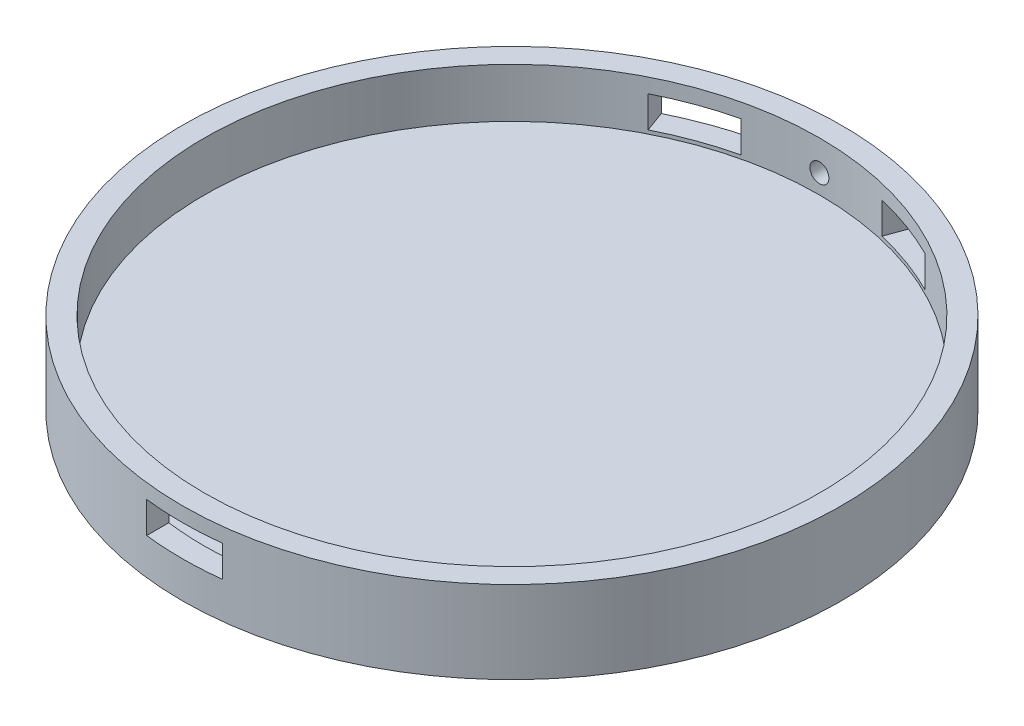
ISO-10303-21;
HEADER;
FILE_DESCRIPTION(('STEP AP214'),'2;1');
FILE_NAME('part.step','',(''),(''),'','','');
FILE_SCHEMA(('AUTOMOTIVE_DESIGN { 1 0 10303 214 1 1 1 1 }'));
ENDSEC;
DATA;
#1=APPLICATION_CONTEXT('core data for automotive mechanical design processes');
#2=APPLICATION_PROTOCOL_DEFINITION('international standard','automotive_design',2000,#1);
#3=PRODUCT_CONTEXT('',#1,'mechanical');
#4=PRODUCT('Part','Part','',(#3));
#5=PRODUCT_RELATED_PRODUCT_CATEGORY('part','',(#4));
#6=PRODUCT_DEFINITION_FORMATION('','',#4);
#7=PRODUCT_DEFINITION_CONTEXT('part definition',#1,'design');
#8=PRODUCT_DEFINITION('design','',#6,#7);
#9=PRODUCT_DEFINITION_SHAPE('','',#8);
#10=(LENGTH_UNIT() NAMED_UNIT(*) SI_UNIT(.MILLI.,.METRE.));
#11=(NAMED_UNIT(*) PLANE_ANGLE_UNIT() SI_UNIT($,.RADIAN.));
#12=(NAMED_UNIT(*) SI_UNIT($,.STERADIAN.) SOLID_ANGLE_UNIT());
#13=UNCERTAINTY_MEASURE_WITH_UNIT(LENGTH_MEASURE(1.E-05),#10,'distance_accuracy_value','');
#14=(GEOMETRIC_REPRESENTATION_CONTEXT(3) GLOBAL_UNCERTAINTY_ASSIGNED_CONTEXT((#13)) GLOBAL_UNIT_ASSIGNED_CONTEXT((#10,
#11,#12)) REPRESENTATION_CONTEXT('',''));
#15=CARTESIAN_POINT('',(0.,0.,0.));
#16=DIRECTION('',(0.,0.,1.));
#17=DIRECTION('',(1.,0.,0.));
#18=AXIS2_PLACEMENT_3D('',#15,#16,#17);
#19=CARTESIAN_POINT('',(0.,15.,0.));
#20=DIRECTION('',(0.,-1.,0.));
#21=DIRECTION('',(0.,0.,-1.));
#22=AXIS2_PLACEMENT_3D('',#19,#20,#21);
#23=CYLINDRICAL_SURFACE('',#22,60.);
#24=DIRECTION('',(0.,-1.,0.));
#25=VECTOR('',#24,1.);
#26=CARTESIAN_POINT('',(-14.2044812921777,15.,-58.2943626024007));
#27=LINE('',#26,#25);
#28=CARTESIAN_POINT('',(-14.2044812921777,6.65,-58.2943626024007));
#29=VERTEX_POINT('',#28);
#30=CARTESIAN_POINT('',(-14.2044812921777,12.35,-58.2943626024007));
#31=VERTEX_POINT('',#30);
#32=EDGE_CURVE('E205',#29,#31,#27,.F.);
#33=ORIENTED_EDGE('',*,*,#32,.T.);
#34=CARTESIAN_POINT('',(0.,12.35,0.));
#35=DIRECTION('',(0.,1.,0.));
#36=DIRECTION('',(-1.,0.,0.));
#37=AXIS2_PLACEMENT_3D('',#34,#35,#36);
#38=CIRCLE('',#37,60.);
#39=CARTESIAN_POINT('',(-26.589630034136,12.35,-53.7865371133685));
#40=VERTEX_POINT('',#39);
#41=EDGE_CURVE('E195',#31,#40,#38,.T.);
#42=ORIENTED_EDGE('',*,*,#41,.T.);
#43=DIRECTION('',(0.,-1.,0.));
#44=VECTOR('',#43,1.);
#45=CARTESIAN_POINT('',(-26.589630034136,15.,-53.7865371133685));
#46=LINE('',#45,#44);
#47=CARTESIAN_POINT('',(-26.589630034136,6.65,-53.7865371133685));
#48=VERTEX_POINT('',#47);
#49=EDGE_CURVE('E210',#40,#48,#46,.T.);
#50=ORIENTED_EDGE('',*,*,#49,.T.);
#51=CARTESIAN_POINT('',(0.,6.65,0.));
#52=DIRECTION('',(0.,-1.,0.));
#53=DIRECTION('',(1.,0.,0.));
#54=AXIS2_PLACEMENT_3D('',#51,#52,#53);
#55=CIRCLE('',#54,60.);
#56=EDGE_CURVE('E208',#48,#29,#55,.T.);
#57=ORIENTED_EDGE('',*,*,#56,.T.);
#58=EDGE_LOOP('',(#33,#42,#50,#57));
#59=FACE_BOUND('',#58,.T.);
#60=DIRECTION('',(0.,-1.,0.));
#61=VECTOR('',#60,1.);
#62=CARTESIAN_POINT('',(14.2044812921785,15.,-58.2943626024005));
#63=LINE('',#62,#61);
#64=CARTESIAN_POINT('',(14.2044812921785,12.35,-58.2943626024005));
#65=VERTEX_POINT('',#64);
#66=CARTESIAN_POINT('',(14.2044812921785,6.65,-58.2943626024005));
#67=VERTEX_POINT('',#66);
#68=EDGE_CURVE('E227',#65,#67,#63,.T.);
#69=ORIENTED_EDGE('',*,*,#68,.T.);
#70=CARTESIAN_POINT('',(0.,6.65,0.));
#71=DIRECTION('',(0.,-1.,0.));
#72=DIRECTION('',(1.,0.,0.));
#73=AXIS2_PLACEMENT_3D('',#70,#71,#72);
#74=CIRCLE('',#73,60.);
#75=CARTESIAN_POINT('',(26.5896300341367,6.65,-53.7865371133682));
#76=VERTEX_POINT('',#75);
#77=EDGE_CURVE('E217',#67,#76,#74,.T.);
#78=ORIENTED_EDGE('',*,*,#77,.T.);
#79=DIRECTION('',(0.,-1.,0.));
#80=VECTOR('',#79,1.);
#81=CARTESIAN_POINT('',(26.5896300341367,15.,-53.7865371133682));
#82=LINE('',#81,#80);
#83=CARTESIAN_POINT('',(26.5896300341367,12.35,-53.7865371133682));
#84=VERTEX_POINT('',#83);
#85=EDGE_CURVE('E232',#76,#84,#82,.F.);
#86=ORIENTED_EDGE('',*,*,#85,.T.);
#87=CARTESIAN_POINT('',(0.,12.35,0.));
#88=DIRECTION('',(0.,1.,0.));
#89=DIRECTION('',(-1.,0.,0.));
#90=AXIS2_PLACEMENT_3D('',#87,#88,#89);
#91=CIRCLE('',#90,60.);
#92=EDGE_CURVE('E230',#84,#65,#91,.T.);
#93=ORIENTED_EDGE('',*,*,#92,.T.);
#94=EDGE_LOOP('',(#69,#78,#86,#93));
#95=FACE_BOUND('',#94,.T.);
#96=CARTESIAN_POINT('',(0.,11.225,-60.));
#97=CARTESIAN_POINT('',(-0.0968725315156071,11.2249957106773,-59.999999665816));
#98=CARTESIAN_POINT('',(-0.193814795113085,11.2168123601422,-59.9997628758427));
#99=CARTESIAN_POINT('',(-0.385028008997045,11.1842817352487,-59.9988410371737));
#100=CARTESIAN_POINT('',(-0.479295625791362,11.1599151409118,-59.9981554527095));
#101=CARTESIAN_POINT('',(-0.662361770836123,11.0957135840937,-59.996413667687));
#102=CARTESIAN_POINT('',(-0.751162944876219,11.0558861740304,-59.9953576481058));
#103=CARTESIAN_POINT('',(-0.920794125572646,10.9619043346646,-59.9929941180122));
#104=CARTESIAN_POINT('',(-1.0016260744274,10.907753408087,-59.9916866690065));
#105=CARTESIAN_POINT('',(-1.15308398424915,10.786634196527,-59.9889668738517));
#106=CARTESIAN_POINT('',(-1.22370623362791,10.7196612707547,-59.9875544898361));
#107=CARTESIAN_POINT('',(-1.35270886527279,10.5748071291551,-59.9847843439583));
#108=CARTESIAN_POINT('',(-1.41108876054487,10.4969254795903,-59.9834265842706));
#109=CARTESIAN_POINT('',(-1.51395478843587,10.3324515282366,-59.9809186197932));
#110=CARTESIAN_POINT('',(-1.55843877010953,10.2458578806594,-59.9797684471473));
#111=CARTESIAN_POINT('',(-1.63223619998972,10.0664276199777,-59.9778056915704));
#112=CARTESIAN_POINT('',(-1.66154970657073,9.9735910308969,-59.9769931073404));
#113=CARTESIAN_POINT('',(-1.7041663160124,9.78433749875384,-59.9757974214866));
#114=CARTESIAN_POINT('',(-1.71747387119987,9.68792155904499,-59.9754142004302));
#115=CARTESIAN_POINT('',(-1.72771453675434,9.49422353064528,-59.9751200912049));
#116=CARTESIAN_POINT('',(-1.72464770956,9.39694144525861,-59.975209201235));
#117=CARTESIAN_POINT('',(-1.70223044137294,9.2043028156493,-59.9758495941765));
#118=CARTESIAN_POINT('',(-1.68288481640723,9.1089457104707,-59.976400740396));
#119=CARTESIAN_POINT('',(-1.62846655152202,8.9228331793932,-59.9779028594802));
#120=CARTESIAN_POINT('',(-1.59339387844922,8.83207776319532,-59.9788538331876));
#121=CARTESIAN_POINT('',(-1.50851157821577,8.65772935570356,-59.9810485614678));
#122=CARTESIAN_POINT('',(-1.45869974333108,8.57413743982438,-59.9822923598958));
#123=CARTESIAN_POINT('',(-1.34575474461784,8.41650071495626,-59.9849324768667));
#124=CARTESIAN_POINT('',(-1.2826215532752,8.34245592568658,-59.9863287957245));
#125=CARTESIAN_POINT('',(-1.14479871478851,8.20598725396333,-59.9891171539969));
#126=CARTESIAN_POINT('',(-1.07010489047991,8.14356759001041,-59.9905091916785));
#127=CARTESIAN_POINT('',(-0.911295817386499,8.03215352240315,-59.9931315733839));
#128=CARTESIAN_POINT('',(-0.827180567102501,7.98315912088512,-59.9943619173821));
#129=CARTESIAN_POINT('',(-0.651914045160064,7.89998683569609,-59.9965222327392));
#130=CARTESIAN_POINT('',(-0.560762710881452,7.86580908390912,-59.9974522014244));
#131=CARTESIAN_POINT('',(-0.374012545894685,7.81324297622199,-59.9989068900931));
#132=CARTESIAN_POINT('',(-0.278413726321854,7.79485458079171,-59.9994316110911));
#133=CARTESIAN_POINT('',(-0.0855189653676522,7.77439433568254,-60.0000165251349));
#134=CARTESIAN_POINT('',(0.0117763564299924,7.77231664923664,-60.0000768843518));
#135=CARTESIAN_POINT('',(0.205334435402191,7.78452159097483,-59.9997267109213));
#136=CARTESIAN_POINT('',(0.301597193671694,7.79880420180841,-59.9993161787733));
#137=CARTESIAN_POINT('',(0.490341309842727,7.84331947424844,-59.9980705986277));
#138=CARTESIAN_POINT('',(0.582823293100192,7.87354948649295,-59.9972356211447));
#139=CARTESIAN_POINT('',(0.761399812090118,7.94909874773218,-59.9952352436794));
#140=CARTESIAN_POINT('',(0.847494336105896,7.99441802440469,-59.9940698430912));
#141=CARTESIAN_POINT('',(1.01087888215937,8.09887439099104,-59.9915394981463));
#142=CARTESIAN_POINT('',(1.088166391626,8.15801540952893,-59.9901744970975));
#143=CARTESIAN_POINT('',(1.23171775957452,8.2884306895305,-59.9873989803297));
#144=CARTESIAN_POINT('',(1.29798159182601,8.35970497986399,-59.9859884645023));
#145=CARTESIAN_POINT('',(1.41762408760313,8.51238858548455,-59.9832804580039));
#146=CARTESIAN_POINT('',(1.47099898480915,8.59380085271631,-59.9819830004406));
#147=CARTESIAN_POINT('',(1.5633227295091,8.76443432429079,-59.9796479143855));
#148=CARTESIAN_POINT('',(1.60227160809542,8.85365551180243,-59.9786102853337));
#149=CARTESIAN_POINT('',(1.6646311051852,9.03735996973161,-59.9769120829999));
#150=CARTESIAN_POINT('',(1.68804416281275,9.13184241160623,-59.9762514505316));
#151=CARTESIAN_POINT('',(1.71867540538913,9.32339912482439,-59.9753815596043));
#152=CARTESIAN_POINT('',(1.72589360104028,9.4204733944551,-59.9751723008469));
#153=CARTESIAN_POINT('',(1.72392993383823,9.61442043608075,-59.9752287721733));
#154=CARTESIAN_POINT('',(1.71475401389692,9.71129326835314,-59.9754943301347));
#155=CARTESIAN_POINT('',(1.68027480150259,9.90212285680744,-59.9764701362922));
#156=CARTESIAN_POINT('',(1.65497147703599,9.99607960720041,-59.9771803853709));
#157=CARTESIAN_POINT('',(1.58895648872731,10.1784123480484,-59.9789654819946));
#158=CARTESIAN_POINT('',(1.54824456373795,10.2667882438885,-59.9800403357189));
#159=CARTESIAN_POINT('',(1.4525702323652,10.4354486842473,-59.9824334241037));
#160=CARTESIAN_POINT('',(1.39760834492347,10.5157335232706,-59.9837516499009));
#161=CARTESIAN_POINT('',(1.27497732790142,10.6659598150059,-59.9864833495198));
#162=CARTESIAN_POINT('',(1.20730494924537,10.7358986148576,-59.9878968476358));
#163=CARTESIAN_POINT('',(1.06115942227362,10.8634415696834,-59.9906598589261));
#164=CARTESIAN_POINT('',(0.982683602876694,10.9210426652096,-59.9920093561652));
#165=CARTESIAN_POINT('',(0.817129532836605,11.0222841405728,-59.9944926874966));
#166=CARTESIAN_POINT('',(0.730045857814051,11.065915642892,-59.9956263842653));
#167=CARTESIAN_POINT('',(0.54985329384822,11.1378880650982,-59.9975478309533));
#168=CARTESIAN_POINT('',(0.456751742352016,11.1662472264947,-59.9983359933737));
#169=CARTESIAN_POINT('',(0.30255138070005,11.1993510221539,-59.9992668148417));
#170=CARTESIAN_POINT('',(0.242453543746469,11.2089572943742,-59.9995405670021));
#171=CARTESIAN_POINT('',(0.121579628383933,11.221783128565,-59.9999072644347));
#172=CARTESIAN_POINT('',(0.0608035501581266,11.2250026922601,-60.0000002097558));
#173=CARTESIAN_POINT('',(0.,11.225,-60.));
#174=B_SPLINE_CURVE_WITH_KNOTS('',3,(#96,#97,#98,#99,#100,#101,#102,#103,#104,#105,#106,#107,
#108,#109,#110,#111,#112,#113,#114,#115,#116,#117,#118,#119,#120,#121,#122,#123,#124,#125,#126,
#127,#128,#129,#130,#131,#132,#133,#134,#135,#136,#137,#138,#139,#140,#141,#142,#143,#144,#145,
#146,#147,#148,#149,#150,#151,#152,#153,#154,#155,#156,#157,#158,#159,#160,#161,#162,#163,#164,
#165,#166,#167,#168,#169,#170,#171,#172,#173),.UNSPECIFIED.,.T.,.F.,(4,2,2,2,2,2,2,2,2,2,2,2,2,
2,2,2,2,2,2,2,2,2,2,2,2,2,2,2,2,2,2,2,2,2,2,2,2,2,4),(0.,0.290395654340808,0.581138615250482,
0.871739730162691,1.16226984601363,1.45290531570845,1.74355234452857,2.03424434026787,
2.32493521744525,2.61554521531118,2.90615410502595,3.19667704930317,3.48720060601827,
3.7777677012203,4.06833539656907,4.35900832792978,4.64968130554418,4.94035687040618,
5.23103170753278,5.52160252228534,5.81217302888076,6.10269527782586,6.39321805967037,
6.68382351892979,6.97442966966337,7.2651206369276,7.5558109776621,7.84645566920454,
8.13710016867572,8.42763933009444,8.71817906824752,9.00872373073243,9.29925781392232,
9.5898662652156,9.88054669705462,10.1714114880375,10.4619280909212,10.6441994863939,
10.8264708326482),.UNSPECIFIED.);
#175=CARTESIAN_POINT('',(0.,11.225,-60.));
#176=VERTEX_POINT('',#175);
#177=EDGE_CURVE('E236',#176,#176,#174,.T.);
#178=ORIENTED_EDGE('',*,*,#177,.T.);
#179=EDGE_LOOP('',(#178));
#180=FACE_BOUND('',#179,.T.);
#181=CARTESIAN_POINT('',(0.,15.,0.));
#182=DIRECTION('',(0.,1.,0.));
#183=DIRECTION('',(0.,0.,1.));
#184=AXIS2_PLACEMENT_3D('',#181,#182,#183);
#185=CIRCLE('',#184,60.);
#186=CARTESIAN_POINT('',(0.,15.,60.));
#187=VERTEX_POINT('',#186);
#188=EDGE_CURVE('E302',#187,#187,#185,.T.);
#189=ORIENTED_EDGE('',*,*,#188,.F.);
#190=EDGE_LOOP('',(#189));
#191=FACE_BOUND('',#190,.T.);
#192=CARTESIAN_POINT('',(0.,0.,0.));
#193=DIRECTION('',(0.,1.,0.));
#194=DIRECTION('',(0.,0.,1.));
#195=AXIS2_PLACEMENT_3D('',#192,#193,#194);
#196=CIRCLE('',#195,60.);
#197=CARTESIAN_POINT('',(0.,0.,60.));
#198=VERTEX_POINT('',#197);
#199=EDGE_CURVE('E264',#198,#198,#196,.T.);
#200=ORIENTED_EDGE('',*,*,#199,.T.);
#201=EDGE_LOOP('',(#200));
#202=FACE_BOUND('',#201,.T.);
#203=CARTESIAN_POINT('',(0.,6.65,0.));
#204=DIRECTION('',(0.,1.,0.));
#205=DIRECTION('',(0.,0.,1.));
#206=AXIS2_PLACEMENT_3D('',#203,#204,#205);
#207=CIRCLE('',#206,60.);
#208=CARTESIAN_POINT('',(-6.9,6.65,59.6019294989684));
#209=VERTEX_POINT('',#208);
#210=CARTESIAN_POINT('',(6.9,6.65,59.6019294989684));
#211=VERTEX_POINT('',#210);
#212=EDGE_CURVE('E84',#209,#211,#207,.T.);
#213=ORIENTED_EDGE('',*,*,#212,.F.);
#214=DIRECTION('',(0.,-1.,0.));
#215=VECTOR('',#214,1.);
#216=CARTESIAN_POINT('',(-6.9,15.,59.6019294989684));
#217=LINE('',#216,#215);
#218=CARTESIAN_POINT('',(-6.9,12.35,59.6019294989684));
#219=VERTEX_POINT('',#218);
#220=EDGE_CURVE('E159',#219,#209,#217,.T.);
#221=ORIENTED_EDGE('',*,*,#220,.F.);
#222=CARTESIAN_POINT('',(0.,12.35,0.));
#223=DIRECTION('',(0.,-1.,0.));
#224=DIRECTION('',(0.,0.,-1.));
#225=AXIS2_PLACEMENT_3D('',#222,#223,#224);
#226=CIRCLE('',#225,60.);
#227=CARTESIAN_POINT('',(6.9,12.35,59.6019294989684));
#228=VERTEX_POINT('',#227);
#229=EDGE_CURVE('E171',#228,#219,#226,.T.);
#230=ORIENTED_EDGE('',*,*,#229,.F.);
#231=DIRECTION('',(0.,-1.,0.));
#232=VECTOR('',#231,1.);
#233=CARTESIAN_POINT('',(6.9,15.,59.6019294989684));
#234=LINE('',#233,#232);
#235=EDGE_CURVE('E165',#211,#228,#234,.F.);
#236=ORIENTED_EDGE('',*,*,#235,.F.);
#237=EDGE_LOOP('',(#213,#221,#230,#236));
#238=FACE_BOUND('',#237,.T.);
#239=ADVANCED_FACE('F69',(#59,#95,#180,#191,#202,#238),#23,.T.);
#240=CARTESIAN_POINT('',(0.,6.,0.));
#241=DIRECTION('',(0.,1.,0.));
#242=DIRECTION('',(0.,0.,1.));
#243=AXIS2_PLACEMENT_3D('',#240,#241,#242);
#244=CYLINDRICAL_SURFACE('',#243,56.);
#245=CARTESIAN_POINT('',(0.,15.,0.));
#246=DIRECTION('',(0.,1.,0.));
#247=DIRECTION('',(0.,0.,1.));
#248=AXIS2_PLACEMENT_3D('',#245,#246,#247);
#249=CIRCLE('',#248,56.);
#250=CARTESIAN_POINT('',(0.,15.,56.));
#251=VERTEX_POINT('',#250);
#252=EDGE_CURVE('E242',#251,#251,#249,.T.);
#253=ORIENTED_EDGE('',*,*,#252,.T.);
#254=EDGE_LOOP('',(#253));
#255=FACE_BOUND('',#254,.T.);
#256=CARTESIAN_POINT('',(0.,6.,0.));
#257=DIRECTION('',(0.,1.,0.));
#258=DIRECTION('',(0.,0.,1.));
#259=AXIS2_PLACEMENT_3D('',#256,#257,#258);
#260=CIRCLE('',#259,56.);
#261=CARTESIAN_POINT('',(0.,6.,56.));
#262=VERTEX_POINT('',#261);
#263=EDGE_CURVE('E243',#262,#262,#260,.T.);
#264=ORIENTED_EDGE('',*,*,#263,.F.);
#265=EDGE_LOOP('',(#264));
#266=FACE_BOUND('',#265,.T.);
#267=CARTESIAN_POINT('',(1.725,9.5,-55.9734256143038));
#268=CARTESIAN_POINT('',(1.72499571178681,9.40313065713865,-55.9734259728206));
#269=CARTESIAN_POINT('',(1.71681289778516,9.30619165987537,-55.9736797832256));
#270=CARTESIAN_POINT('',(1.68428452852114,9.11498510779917,-55.974667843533));
#271=CARTESIAN_POINT('',(1.65991967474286,9.02072088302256,-55.975402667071));
#272=CARTESIAN_POINT('',(1.59572301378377,8.83766154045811,-55.977269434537));
#273=CARTESIAN_POINT('',(1.55589878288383,8.74886376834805,-55.9784011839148));
#274=CARTESIAN_POINT('',(1.46192472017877,8.5792387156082,-55.9809340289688));
#275=CARTESIAN_POINT('',(1.40777838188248,8.49840949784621,-55.9823350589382));
#276=CARTESIAN_POINT('',(1.28666716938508,8.34695290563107,-55.9852493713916));
#277=CARTESIAN_POINT('',(1.2196971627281,8.27632963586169,-55.9867626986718));
#278=CARTESIAN_POINT('',(1.07484867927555,8.14732423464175,-55.9897306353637));
#279=CARTESIAN_POINT('',(0.996969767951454,8.08894259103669,-55.9911852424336));
#280=CARTESIAN_POINT('',(0.832498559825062,7.98607097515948,-55.9938720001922));
#281=CARTESIAN_POINT('',(0.745904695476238,7.94158350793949,-55.995104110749));
#282=CARTESIAN_POINT('',(0.566472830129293,7.8677793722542,-55.9972066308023));
#283=CARTESIAN_POINT('',(0.473634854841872,7.83846264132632,-55.998077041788));
#284=CARTESIAN_POINT('',(0.284381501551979,7.79584111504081,-55.9993578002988));
#285=CARTESIAN_POINT('',(0.187967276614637,7.78253120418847,-55.9997682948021));
#286=CARTESIAN_POINT('',(-0.00572783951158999,7.77228537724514,-56.0000834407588));
#287=CARTESIAN_POINT('',(-0.103008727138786,7.77534939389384,-55.9999880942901));
#288=CARTESIAN_POINT('',(-0.29564106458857,7.79776012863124,-55.9993024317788));
#289=CARTESIAN_POINT('',(-0.390993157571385,7.81710132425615,-55.9987122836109));
#290=CARTESIAN_POINT('',(-0.577096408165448,7.87150884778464,-55.9971037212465));
#291=CARTESIAN_POINT('',(-0.667847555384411,7.90657521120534,-55.9960853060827));
#292=CARTESIAN_POINT('',(-0.842190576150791,7.99144399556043,-55.9937346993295));
#293=CARTESIAN_POINT('',(-0.925781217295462,8.04124894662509,-55.9924024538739));
#294=CARTESIAN_POINT('',(-1.08341687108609,8.15417924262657,-55.9895743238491));
#295=CARTESIAN_POINT('',(-1.15746186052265,8.21730461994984,-55.988078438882));
#296=CARTESIAN_POINT('',(-1.29393654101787,8.35511512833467,-55.9850908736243));
#297=CARTESIAN_POINT('',(-1.35636139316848,8.42980505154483,-55.9835991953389));
#298=CARTESIAN_POINT('',(-1.46778652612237,8.58860757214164,-55.9807888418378));
#299=CARTESIAN_POINT('',(-1.51678680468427,8.67272017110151,-55.979470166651));
#300=CARTESIAN_POINT('',(-1.59997132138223,8.84798310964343,-55.9771545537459));
#301=CARTESIAN_POINT('',(-1.63415540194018,8.93913352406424,-55.9761576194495));
#302=CARTESIAN_POINT('',(-1.68673403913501,9.12588341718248,-55.9745980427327));
#303=CARTESIAN_POINT('',(-1.70512864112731,9.22148288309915,-55.9740353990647));
#304=CARTESIAN_POINT('',(-1.72560022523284,9.41437504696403,-55.9734080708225));
#305=CARTESIAN_POINT('',(-1.7276839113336,9.51166703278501,-55.9733431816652));
#306=CARTESIAN_POINT('',(-1.71549198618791,9.7052194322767,-55.9737181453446));
#307=CARTESIAN_POINT('',(-1.70121639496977,9.8014798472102,-55.9741579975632));
#308=CARTESIAN_POINT('',(-1.65671670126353,9.99021789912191,-55.9754926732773));
#309=CARTESIAN_POINT('',(-1.62649564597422,10.0826962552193,-55.9763874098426));
#310=CARTESIAN_POINT('',(-1.5509659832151,10.2612671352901,-55.9785309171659));
#311=CARTESIAN_POINT('',(-1.50565734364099,10.3473596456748,-55.9797796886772));
#312=CARTESIAN_POINT('',(-1.40122138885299,10.5107458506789,-55.982490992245));
#313=CARTESIAN_POINT('',(-1.34208955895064,10.5880366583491,-55.9839535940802));
#314=CARTESIAN_POINT('',(-1.21169238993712,10.7315964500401,-55.9869274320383));
#315=CARTESIAN_POINT('',(-1.14042701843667,10.7978654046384,-55.988438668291));
#316=CARTESIAN_POINT('',(-0.987757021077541,10.9175227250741,-55.9913400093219));
#317=CARTESIAN_POINT('',(-0.906349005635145,10.9709067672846,-55.9927300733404));
#318=CARTESIAN_POINT('',(-0.73572189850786,11.063249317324,-55.9952317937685));
#319=CARTESIAN_POINT('',(-0.646502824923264,11.1022078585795,-55.9963434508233));
#320=CARTESIAN_POINT('',(-0.462802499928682,11.1645859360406,-55.9981628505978));
#321=CARTESIAN_POINT('',(-0.368322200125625,11.1880082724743,-55.9988706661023));
#322=CARTESIAN_POINT('',(-0.17676789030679,11.2186582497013,-55.9998028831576));
#323=CARTESIAN_POINT('',(-0.0796938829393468,11.2258859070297,-56.0000272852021));
#324=CARTESIAN_POINT('',(0.11424904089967,11.2239410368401,-55.9999673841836));
#325=CARTESIAN_POINT('',(0.211118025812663,11.2147753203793,-55.9996832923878));
#326=CARTESIAN_POINT('',(0.401941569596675,11.1803178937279,-55.998638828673));
#327=CARTESIAN_POINT('',(0.495896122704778,11.1550261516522,-55.9978784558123));
#328=CARTESIAN_POINT('',(0.678226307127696,11.089035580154,-55.9959670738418));
#329=CARTESIAN_POINT('',(0.766601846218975,11.0483364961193,-55.9948160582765));
#330=CARTESIAN_POINT('',(0.935263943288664,10.9526888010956,-55.9922530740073));
#331=CARTESIAN_POINT('',(1.01555079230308,10.8977407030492,-55.9908411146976));
#332=CARTESIAN_POINT('',(1.16578795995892,10.775134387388,-55.9879147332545));
#333=CARTESIAN_POINT('',(1.23573507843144,10.707472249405,-55.9864002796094));
#334=CARTESIAN_POINT('',(1.3632965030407,10.5613456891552,-55.9834395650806));
#335=CARTESIAN_POINT('',(1.4209077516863,10.4828785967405,-55.981993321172));
#336=CARTESIAN_POINT('',(1.52217238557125,10.3173378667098,-55.9793316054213));
#337=CARTESIAN_POINT('',(1.56581656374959,10.2302586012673,-55.9781162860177));
#338=CARTESIAN_POINT('',(1.63781474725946,10.0500720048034,-55.9760562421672));
#339=CARTESIAN_POINT('',(1.66618698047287,9.95697200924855,-55.9752110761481));
#340=CARTESIAN_POINT('',(1.69931933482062,9.80273684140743,-55.9742125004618));
#341=CARTESIAN_POINT('',(1.70893746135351,9.74260271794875,-55.9739187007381));
#342=CARTESIAN_POINT('',(1.72177913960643,9.62165488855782,-55.9735251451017));
#343=CARTESIAN_POINT('',(1.72500269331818,9.56084118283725,-55.9734253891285));
#344=CARTESIAN_POINT('',(1.725,9.5,-55.9734256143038));
#345=B_SPLINE_CURVE_WITH_KNOTS('',3,(#267,#268,#269,#270,#271,#272,#273,#274,#275,#276,#277,
#278,#279,#280,#281,#282,#283,#284,#285,#286,#287,#288,#289,#290,#291,#292,#293,#294,#295,#296,
#297,#298,#299,#300,#301,#302,#303,#304,#305,#306,#307,#308,#309,#310,#311,#312,#313,#314,#315,
#316,#317,#318,#319,#320,#321,#322,#323,#324,#325,#326,#327,#328,#329,#330,#331,#332,#333,#334,
#335,#336,#337,#338,#339,#340,#341,#342,#343,#344),.UNSPECIFIED.,.T.,.F.,(4,2,2,2,2,2,2,2,2,2,2,
2,2,2,2,2,2,2,2,2,2,2,2,2,2,2,2,2,2,2,2,2,2,2,2,2,2,2,4),(0.,0.290385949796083,0.58111883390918,
0.871709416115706,1.16222918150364,1.45286546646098,1.74351333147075,2.03421356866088,
2.32491260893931,2.61551872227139,2.90612364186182,3.19663000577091,3.48713702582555,
3.77769394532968,4.06825157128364,4.35892992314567,4.64960832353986,4.94028981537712,
5.23097047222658,5.52153164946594,5.81209247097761,6.10259778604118,6.3931037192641,
6.68370466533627,6.97430638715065,7.26500548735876,7.55570391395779,7.84634993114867,
8.13699565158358,8.42752064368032,8.7180462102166,9.00857657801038,9.29909648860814,
9.5897061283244,9.8803877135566,10.1712605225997,10.4617853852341,10.6441695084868,
10.8265535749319),.UNSPECIFIED.);
#346=CARTESIAN_POINT('',(1.725,9.5,-55.9734256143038));
#347=VERTEX_POINT('',#346);
#348=EDGE_CURVE('E235',#347,#347,#345,.T.);
#349=ORIENTED_EDGE('',*,*,#348,.T.);
#350=EDGE_LOOP('',(#349));
#351=FACE_BOUND('',#350,.T.);
#352=CARTESIAN_POINT('',(0.,12.35,0.));
#353=DIRECTION('',(0.,1.,0.));
#354=DIRECTION('',(-1.,0.,0.));
#355=AXIS2_PLACEMENT_3D('',#352,#353,#354);
#356=CIRCLE('',#355,56.);
#357=CARTESIAN_POINT('',(12.8274726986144,12.35,-54.5110625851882));
#358=VERTEX_POINT('',#357);
#359=CARTESIAN_POINT('',(25.2126214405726,12.35,-50.0032370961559));
#360=VERTEX_POINT('',#359);
#361=EDGE_CURVE('E318',#358,#360,#356,.F.);
#362=ORIENTED_EDGE('',*,*,#361,.T.);
#363=DIRECTION('',(0.,1.,0.));
#364=VECTOR('',#363,1.);
#365=CARTESIAN_POINT('',(25.2126214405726,6.,-50.0032370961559));
#366=LINE('',#365,#364);
#367=CARTESIAN_POINT('',(25.2126214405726,6.65,-50.0032370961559));
#368=VERTEX_POINT('',#367);
#369=EDGE_CURVE('E401',#360,#368,#366,.F.);
#370=ORIENTED_EDGE('',*,*,#369,.T.);
#371=CARTESIAN_POINT('',(0.,6.65,0.));
#372=DIRECTION('',(0.,-1.,0.));
#373=DIRECTION('',(1.,0.,0.));
#374=AXIS2_PLACEMENT_3D('',#371,#372,#373);
#375=CIRCLE('',#374,56.);
#376=CARTESIAN_POINT('',(12.8274726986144,6.65,-54.5110625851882));
#377=VERTEX_POINT('',#376);
#378=EDGE_CURVE('E266',#368,#377,#375,.F.);
#379=ORIENTED_EDGE('',*,*,#378,.T.);
#380=DIRECTION('',(0.,1.,0.));
#381=VECTOR('',#380,1.);
#382=CARTESIAN_POINT('',(12.8274726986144,6.,-54.5110625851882));
#383=LINE('',#382,#381);
#384=EDGE_CURVE('E400',#377,#358,#383,.T.);
#385=ORIENTED_EDGE('',*,*,#384,.T.);
#386=EDGE_LOOP('',(#362,#370,#379,#385));
#387=FACE_BOUND('',#386,.T.);
#388=CARTESIAN_POINT('',(0.,6.65,0.));
#389=DIRECTION('',(0.,-1.,0.));
#390=DIRECTION('',(1.,0.,0.));
#391=AXIS2_PLACEMENT_3D('',#388,#389,#390);
#392=CIRCLE('',#391,56.);
#393=CARTESIAN_POINT('',(-12.8274726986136,6.65,-54.5110625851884));
#394=VERTEX_POINT('',#393);
#395=CARTESIAN_POINT('',(-25.212621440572,6.65,-50.0032370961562));
#396=VERTEX_POINT('',#395);
#397=EDGE_CURVE('E323',#394,#396,#392,.F.);
#398=ORIENTED_EDGE('',*,*,#397,.T.);
#399=DIRECTION('',(0.,1.,0.));
#400=VECTOR('',#399,1.);
#401=CARTESIAN_POINT('',(-25.212621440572,6.,-50.0032370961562));
#402=LINE('',#401,#400);
#403=CARTESIAN_POINT('',(-25.2126214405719,12.35,-50.0032370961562));
#404=VERTEX_POINT('',#403);
#405=EDGE_CURVE('E188',#396,#404,#402,.T.);
#406=ORIENTED_EDGE('',*,*,#405,.T.);
#407=CARTESIAN_POINT('',(0.,12.35,0.));
#408=DIRECTION('',(0.,1.,0.));
#409=DIRECTION('',(-1.,0.,0.));
#410=AXIS2_PLACEMENT_3D('',#407,#408,#409);
#411=CIRCLE('',#410,56.);
#412=CARTESIAN_POINT('',(-12.8274726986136,12.35,-54.5110625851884));
#413=VERTEX_POINT('',#412);
#414=EDGE_CURVE('E404',#404,#413,#411,.F.);
#415=ORIENTED_EDGE('',*,*,#414,.T.);
#416=DIRECTION('',(0.,1.,0.));
#417=VECTOR('',#416,1.);
#418=CARTESIAN_POINT('',(-12.8274726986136,6.,-54.5110625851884));
#419=LINE('',#418,#417);
#420=EDGE_CURVE('E407',#413,#394,#419,.F.);
#421=ORIENTED_EDGE('',*,*,#420,.T.);
#422=EDGE_LOOP('',(#398,#406,#415,#421));
#423=FACE_BOUND('',#422,.T.);
#424=DIRECTION('',(0.,1.,0.));
#425=VECTOR('',#424,1.);
#426=CARTESIAN_POINT('',(6.9,6.,55.5732849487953));
#427=LINE('',#426,#425);
#428=CARTESIAN_POINT('',(6.9,12.35,55.5732849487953));
#429=VERTEX_POINT('',#428);
#430=CARTESIAN_POINT('',(6.9,6.65,55.5732849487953));
#431=VERTEX_POINT('',#430);
#432=EDGE_CURVE('E12',#429,#431,#427,.F.);
#433=ORIENTED_EDGE('',*,*,#432,.F.);
#434=CARTESIAN_POINT('',(0.,12.35,0.));
#435=DIRECTION('',(0.,-1.,0.));
#436=DIRECTION('',(0.,0.,-1.));
#437=AXIS2_PLACEMENT_3D('',#434,#435,#436);
#438=CIRCLE('',#437,56.);
#439=CARTESIAN_POINT('',(-6.9,12.35,55.5732849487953));
#440=VERTEX_POINT('',#439);
#441=EDGE_CURVE('E77',#440,#429,#438,.F.);
#442=ORIENTED_EDGE('',*,*,#441,.F.);
#443=DIRECTION('',(0.,1.,0.));
#444=VECTOR('',#443,1.);
#445=CARTESIAN_POINT('',(-6.9,6.,55.5732849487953));
#446=LINE('',#445,#444);
#447=CARTESIAN_POINT('',(-6.9,6.65,55.5732849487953));
#448=VERTEX_POINT('',#447);
#449=EDGE_CURVE('E327',#448,#440,#446,.T.);
#450=ORIENTED_EDGE('',*,*,#449,.F.);
#451=CARTESIAN_POINT('',(0.,6.65,0.));
#452=DIRECTION('',(0.,1.,0.));
#453=DIRECTION('',(0.,0.,1.));
#454=AXIS2_PLACEMENT_3D('',#451,#452,#453);
#455=CIRCLE('',#454,56.);
#456=EDGE_CURVE('E326',#431,#448,#455,.F.);
#457=ORIENTED_EDGE('',*,*,#456,.F.);
#458=EDGE_LOOP('',(#433,#442,#450,#457));
#459=FACE_BOUND('',#458,.T.);
#460=ADVANCED_FACE('F268',(#255,#266,#351,#387,#423,#459),#244,.F.);
#461=CARTESIAN_POINT('',(0.,15.,0.));
#462=DIRECTION('',(0.,1.,0.));
#463=DIRECTION('',(0.,0.,1.));
#464=AXIS2_PLACEMENT_3D('',#461,#462,#463);
#465=PLANE('',#464);
#466=ORIENTED_EDGE('',*,*,#252,.F.);
#467=EDGE_LOOP('',(#466));
#468=FACE_BOUND('',#467,.T.);
#469=ORIENTED_EDGE('',*,*,#188,.T.);
#470=EDGE_LOOP('',(#469));
#471=FACE_BOUND('',#470,.T.);
#472=ADVANCED_FACE('F272',(#468,#471),#465,.T.);
#473=CARTESIAN_POINT('',(0.,0.,0.));
#474=DIRECTION('',(0.,1.,0.));
#475=DIRECTION('',(0.,0.,1.));
#476=AXIS2_PLACEMENT_3D('',#473,#474,#475);
#477=PLANE('',#476);
#478=CARTESIAN_POINT('',(0.,0.,-29.4419549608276));
#479=DIRECTION('',(0.,1.,0.));
#480=DIRECTION('',(0.,0.,1.));
#481=AXIS2_PLACEMENT_3D('',#478,#479,#480);
#482=ELLIPSE('',#481,12.6928326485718,12.5);
#483=CARTESIAN_POINT('',(0.,0.,-16.7491223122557));
#484=VERTEX_POINT('',#483);
#485=EDGE_CURVE('E183',#484,#484,#482,.T.);
#486=ORIENTED_EDGE('',*,*,#485,.T.);
#487=EDGE_LOOP('',(#486));
#488=FACE_BOUND('',#487,.T.);
#489=ORIENTED_EDGE('',*,*,#199,.F.);
#490=EDGE_LOOP('',(#489));
#491=FACE_BOUND('',#490,.T.);
#492=ADVANCED_FACE('F275',(#488,#491),#477,.F.);
#493=CARTESIAN_POINT('',(0.,6.,0.));
#494=DIRECTION('',(0.,1.,0.));
#495=DIRECTION('',(0.,0.,1.));
#496=AXIS2_PLACEMENT_3D('',#493,#494,#495);
#497=PLANE('',#496);
#498=ORIENTED_EDGE('',*,*,#263,.T.);
#499=EDGE_LOOP('',(#498));
#500=FACE_BOUND('',#499,.T.);
#501=ADVANCED_FACE('F253',(#500),#497,.T.);
#502=CARTESIAN_POINT('',(0.,9.5,-60.));
#503=DIRECTION('',(0.,0.,1.));
#504=DIRECTION('',(1.,0.,0.));
#505=AXIS2_PLACEMENT_3D('',#502,#503,#504);
#506=CYLINDRICAL_SURFACE('',#505,1.725);
#507=ORIENTED_EDGE('',*,*,#348,.F.);
#508=EDGE_LOOP('',(#507));
#509=FACE_BOUND('',#508,.T.);
#510=ORIENTED_EDGE('',*,*,#177,.F.);
#511=EDGE_LOOP('',(#510));
#512=FACE_BOUND('',#511,.T.);
#513=ADVANCED_FACE('F247',(#509,#512),#506,.F.);
#514=CARTESIAN_POINT('',(23.6356016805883,12.35,-45.6704109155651));
#515=DIRECTION('',(0.939692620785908,0.,0.342020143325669));
#516=DIRECTION('',(0.342020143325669,0.,-0.939692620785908));
#517=AXIS2_PLACEMENT_3D('',#514,#515,#516);
#518=PLANE('',#517);
#519=DIRECTION('',(0.342020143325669,0.,-0.939692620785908));
#520=VECTOR('',#519,1.);
#521=CARTESIAN_POINT('',(23.6356016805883,6.65,-45.6704109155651));
#522=LINE('',#521,#520);
#523=EDGE_CURVE('E213',#368,#76,#522,.T.);
#524=ORIENTED_EDGE('',*,*,#523,.F.);
#525=ORIENTED_EDGE('',*,*,#369,.F.);
#526=DIRECTION('',(0.342020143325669,0.,-0.939692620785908));
#527=VECTOR('',#526,1.);
#528=CARTESIAN_POINT('',(23.6356016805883,12.35,-45.6704109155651));
#529=LINE('',#528,#527);
#530=EDGE_CURVE('E214',#360,#84,#529,.T.);
#531=ORIENTED_EDGE('',*,*,#530,.T.);
#532=ORIENTED_EDGE('',*,*,#85,.F.);
#533=EDGE_LOOP('',(#524,#525,#531,#532));
#534=FACE_BOUND('',#533,.T.);
#535=ADVANCED_FACE('F252',(#534),#518,.F.);
#536=CARTESIAN_POINT('',(11.25045293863,12.35,-50.1782364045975));
#537=DIRECTION('',(0.,1.,0.));
#538=DIRECTION('',(-1.,0.,0.));
#539=AXIS2_PLACEMENT_3D('',#536,#537,#538);
#540=PLANE('',#539);
#541=ORIENTED_EDGE('',*,*,#530,.F.);
#542=ORIENTED_EDGE('',*,*,#361,.F.);
#543=DIRECTION('',(0.342020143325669,0.,-0.939692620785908));
#544=VECTOR('',#543,1.);
#545=CARTESIAN_POINT('',(11.25045293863,12.35,-50.1782364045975));
#546=LINE('',#545,#544);
#547=EDGE_CURVE('E218',#358,#65,#546,.T.);
#548=ORIENTED_EDGE('',*,*,#547,.T.);
#549=ORIENTED_EDGE('',*,*,#92,.F.);
#550=EDGE_LOOP('',(#541,#542,#548,#549));
#551=FACE_BOUND('',#550,.T.);
#552=ADVANCED_FACE('F385',(#551),#540,.F.);
#553=CARTESIAN_POINT('',(11.25045293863,6.65,-50.1782364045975));
#554=DIRECTION('',(-0.939692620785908,0.,-0.342020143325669));
#555=DIRECTION('',(-0.342020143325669,0.,0.939692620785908));
#556=AXIS2_PLACEMENT_3D('',#553,#554,#555);
#557=PLANE('',#556);
#558=ORIENTED_EDGE('',*,*,#547,.F.);
#559=ORIENTED_EDGE('',*,*,#384,.F.);
#560=DIRECTION('',(0.342020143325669,0.,-0.939692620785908));
#561=VECTOR('',#560,1.);
#562=CARTESIAN_POINT('',(11.25045293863,6.65,-50.1782364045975));
#563=LINE('',#562,#561);
#564=EDGE_CURVE('E221',#377,#67,#563,.T.);
#565=ORIENTED_EDGE('',*,*,#564,.T.);
#566=ORIENTED_EDGE('',*,*,#68,.F.);
#567=EDGE_LOOP('',(#558,#559,#565,#566));
#568=FACE_BOUND('',#567,.T.);
#569=ADVANCED_FACE('F388',(#568),#557,.F.);
#570=CARTESIAN_POINT('',(23.6356016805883,6.65,-45.6704109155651));
#571=DIRECTION('',(0.,-1.,0.));
#572=DIRECTION('',(1.,0.,0.));
#573=AXIS2_PLACEMENT_3D('',#570,#571,#572);
#574=PLANE('',#573);
#575=ORIENTED_EDGE('',*,*,#564,.F.);
#576=ORIENTED_EDGE('',*,*,#378,.F.);
#577=ORIENTED_EDGE('',*,*,#523,.T.);
#578=ORIENTED_EDGE('',*,*,#77,.F.);
#579=EDGE_LOOP('',(#575,#576,#577,#578));
#580=FACE_BOUND('',#579,.T.);
#581=ADVANCED_FACE('F383',(#580),#574,.F.);
#582=CARTESIAN_POINT('',(-23.6356016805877,6.65,-45.6704109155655));
#583=DIRECTION('',(-0.939692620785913,0.,0.342020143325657));
#584=DIRECTION('',(0.342020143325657,0.,0.939692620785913));
#585=AXIS2_PLACEMENT_3D('',#582,#583,#584);
#586=PLANE('',#585);
#587=DIRECTION('',(-0.342020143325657,0.,-0.939692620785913));
#588=VECTOR('',#587,1.);
#589=CARTESIAN_POINT('',(-23.6356016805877,12.35,-45.6704109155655));
#590=LINE('',#589,#588);
#591=EDGE_CURVE('E191',#404,#40,#590,.T.);
#592=ORIENTED_EDGE('',*,*,#591,.F.);
#593=ORIENTED_EDGE('',*,*,#405,.F.);
#594=DIRECTION('',(-0.342020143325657,0.,-0.939692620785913));
#595=VECTOR('',#594,1.);
#596=CARTESIAN_POINT('',(-23.6356016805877,6.65,-45.6704109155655));
#597=LINE('',#596,#595);
#598=EDGE_CURVE('E192',#396,#48,#597,.T.);
#599=ORIENTED_EDGE('',*,*,#598,.T.);
#600=ORIENTED_EDGE('',*,*,#49,.F.);
#601=EDGE_LOOP('',(#592,#593,#599,#600));
#602=FACE_BOUND('',#601,.T.);
#603=ADVANCED_FACE('F373',(#602),#586,.F.);
#604=CARTESIAN_POINT('',(-11.2504529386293,6.65,-50.1782364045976));
#605=DIRECTION('',(0.,-1.,0.));
#606=DIRECTION('',(1.,0.,0.));
#607=AXIS2_PLACEMENT_3D('',#604,#605,#606);
#608=PLANE('',#607);
#609=ORIENTED_EDGE('',*,*,#598,.F.);
#610=ORIENTED_EDGE('',*,*,#397,.F.);
#611=DIRECTION('',(-0.342020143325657,0.,-0.939692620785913));
#612=VECTOR('',#611,1.);
#613=CARTESIAN_POINT('',(-11.2504529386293,6.65,-50.1782364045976));
#614=LINE('',#613,#612);
#615=EDGE_CURVE('E196',#394,#29,#614,.T.);
#616=ORIENTED_EDGE('',*,*,#615,.T.);
#617=ORIENTED_EDGE('',*,*,#56,.F.);
#618=EDGE_LOOP('',(#609,#610,#616,#617));
#619=FACE_BOUND('',#618,.T.);
#620=ADVANCED_FACE('F369',(#619),#608,.F.);
#621=CARTESIAN_POINT('',(-11.2504529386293,12.35,-50.1782364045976));
#622=DIRECTION('',(0.939692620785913,0.,-0.342020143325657));
#623=DIRECTION('',(-0.342020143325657,0.,-0.939692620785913));
#624=AXIS2_PLACEMENT_3D('',#621,#622,#623);
#625=PLANE('',#624);
#626=ORIENTED_EDGE('',*,*,#615,.F.);
#627=ORIENTED_EDGE('',*,*,#420,.F.);
#628=DIRECTION('',(-0.342020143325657,0.,-0.939692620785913));
#629=VECTOR('',#628,1.);
#630=CARTESIAN_POINT('',(-11.2504529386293,12.35,-50.1782364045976));
#631=LINE('',#630,#629);
#632=EDGE_CURVE('E199',#413,#31,#631,.T.);
#633=ORIENTED_EDGE('',*,*,#632,.T.);
#634=ORIENTED_EDGE('',*,*,#32,.F.);
#635=EDGE_LOOP('',(#626,#627,#633,#634));
#636=FACE_BOUND('',#635,.T.);
#637=ADVANCED_FACE('F372',(#636),#625,.F.);
#638=CARTESIAN_POINT('',(-23.6356016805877,12.35,-45.6704109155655));
#639=DIRECTION('',(0.,1.,0.));
#640=DIRECTION('',(-1.,0.,0.));
#641=AXIS2_PLACEMENT_3D('',#638,#639,#640);
#642=PLANE('',#641);
#643=ORIENTED_EDGE('',*,*,#632,.F.);
#644=ORIENTED_EDGE('',*,*,#414,.F.);
#645=ORIENTED_EDGE('',*,*,#591,.T.);
#646=ORIENTED_EDGE('',*,*,#41,.F.);
#647=EDGE_LOOP('',(#643,#644,#645,#646));
#648=FACE_BOUND('',#647,.T.);
#649=ADVANCED_FACE('F364',(#648),#642,.F.);
#650=CARTESIAN_POINT('',(0.,41.0867755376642,-36.6866620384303));
#651=DIRECTION('',(0.,-0.984807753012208,0.173648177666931));
#652=DIRECTION('',(0.,-0.173648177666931,-0.984807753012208));
#653=AXIS2_PLACEMENT_3D('',#650,#651,#652);
#654=CYLINDRICAL_SURFACE('',#653,12.5);
#655=CARTESIAN_POINT('',(0.,-12.9944324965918,-27.1506859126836));
#656=DIRECTION('',(0.,-0.984807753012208,0.173648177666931));
#657=DIRECTION('',(0.,-0.173648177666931,-0.984807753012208));
#658=AXIS2_PLACEMENT_3D('',#655,#656,#657);
#659=CIRCLE('',#658,12.5);
#660=CARTESIAN_POINT('',(0.,-15.1650347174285,-39.4607828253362));
#661=VERTEX_POINT('',#660);
#662=EDGE_CURVE('E187',#661,#661,#659,.F.);
#663=ORIENTED_EDGE('',*,*,#662,.T.);
#664=EDGE_LOOP('',(#663));
#665=FACE_BOUND('',#664,.T.);
#666=ORIENTED_EDGE('',*,*,#485,.F.);
#667=EDGE_LOOP('',(#666));
#668=FACE_BOUND('',#667,.T.);
#669=ADVANCED_FACE('F361',(#665,#668),#654,.T.);
#670=CARTESIAN_POINT('',(0.,41.0867755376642,-36.6866620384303));
#671=DIRECTION('',(0.,-0.984807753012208,0.173648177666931));
#672=DIRECTION('',(0.,-0.173648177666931,-0.984807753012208));
#673=AXIS2_PLACEMENT_3D('',#670,#671,#672);
#674=CYLINDRICAL_SURFACE('',#673,9.5);
#675=CARTESIAN_POINT('',(0.,-19.6007237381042,-25.9858185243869));
#676=DIRECTION('',(0.,-0.984807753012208,0.173648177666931));
#677=DIRECTION('',(0.,-0.173648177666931,-0.984807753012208));
#678=AXIS2_PLACEMENT_3D('',#675,#676,#677);
#679=CIRCLE('',#678,9.5);
#680=CARTESIAN_POINT('',(0.,-21.25038142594,-35.3414921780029));
#681=VERTEX_POINT('',#680);
#682=EDGE_CURVE('E180',#681,#681,#679,.T.);
#683=ORIENTED_EDGE('',*,*,#682,.T.);
#684=EDGE_LOOP('',(#683));
#685=FACE_BOUND('',#684,.T.);
#686=CARTESIAN_POINT('',(0.,0.,-29.4419549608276));
#687=DIRECTION('',(0.,1.,0.));
#688=DIRECTION('',(0.,0.,1.));
#689=AXIS2_PLACEMENT_3D('',#686,#687,#688);
#690=ELLIPSE('',#689,9.64655281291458,9.5);
#691=CARTESIAN_POINT('',(0.,0.,-19.795402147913));
#692=VERTEX_POINT('',#691);
#693=EDGE_CURVE('E184',#692,#692,#690,.T.);
#694=ORIENTED_EDGE('',*,*,#693,.T.);
#695=EDGE_LOOP('',(#694));
#696=FACE_BOUND('',#695,.T.);
#697=ADVANCED_FACE('F287',(#685,#696),#674,.F.);
#698=CARTESIAN_POINT('',(0.,0.,-29.4419549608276));
#699=DIRECTION('',(0.,1.,0.));
#700=DIRECTION('',(0.,0.,1.));
#701=AXIS2_PLACEMENT_3D('',#698,#699,#700);
#702=ELLIPSE('',#701,8.63112620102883,8.5);
#703=CARTESIAN_POINT('',(0.,0.,-20.8108287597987));
#704=VERTEX_POINT('',#703);
#705=EDGE_CURVE('E175',#704,#704,#702,.T.);
#706=ORIENTED_EDGE('',*,*,#705,.T.);
#707=EDGE_LOOP('',(#706));
#708=FACE_BOUND('',#707,.T.);
#709=ORIENTED_EDGE('',*,*,#693,.F.);
#710=EDGE_LOOP('',(#709));
#711=FACE_BOUND('',#710,.T.);
#712=ADVANCED_FACE('F279',(#708,#711),#477,.F.);
#713=CARTESIAN_POINT('',(0.,41.0867755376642,-36.6866620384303));
#714=DIRECTION('',(0.,-0.984807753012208,0.173648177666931));
#715=DIRECTION('',(0.,-0.173648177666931,-0.984807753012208));
#716=AXIS2_PLACEMENT_3D('',#713,#714,#715);
#717=CYLINDRICAL_SURFACE('',#716,8.5);
#718=CARTESIAN_POINT('',(0.,-19.6007237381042,-25.9858185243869));
#719=DIRECTION('',(0.,-0.984807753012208,0.173648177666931));
#720=DIRECTION('',(0.,-0.173648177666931,-0.984807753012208));
#721=AXIS2_PLACEMENT_3D('',#718,#719,#720);
#722=CIRCLE('',#721,8.5);
#723=CARTESIAN_POINT('',(0.,-21.0767332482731,-34.3566844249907));
#724=VERTEX_POINT('',#723);
#725=EDGE_CURVE('E172',#724,#724,#722,.T.);
#726=ORIENTED_EDGE('',*,*,#725,.F.);
#727=EDGE_LOOP('',(#726));
#728=FACE_BOUND('',#727,.T.);
#729=ORIENTED_EDGE('',*,*,#705,.F.);
#730=EDGE_LOOP('',(#729));
#731=FACE_BOUND('',#730,.T.);
#732=ADVANCED_FACE('F286',(#728,#731),#717,.T.);
#733=CARTESIAN_POINT('',(0.,-19.6007237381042,-25.9858185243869));
#734=DIRECTION('',(0.,-0.984807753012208,0.173648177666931));
#735=DIRECTION('',(0.,-0.173648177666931,-0.984807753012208));
#736=AXIS2_PLACEMENT_3D('',#733,#734,#735);
#737=PLANE('',#736);
#738=ORIENTED_EDGE('',*,*,#725,.T.);
#739=EDGE_LOOP('',(#738));
#740=FACE_BOUND('',#739,.T.);
#741=ADVANCED_FACE('F356',(#740),#737,.T.);
#742=CARTESIAN_POINT('',(0.,-12.9944324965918,-27.1506859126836));
#743=DIRECTION('',(0.,-0.984807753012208,0.173648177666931));
#744=DIRECTION('',(0.,-0.173648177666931,-0.984807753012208));
#745=AXIS2_PLACEMENT_3D('',#742,#743,#744);
#746=DEGENERATE_TOROIDAL_SURFACE('',#745,3.5,9.,.T.);
#747=ORIENTED_EDGE('',*,*,#662,.F.);
#748=EDGE_LOOP('',(#747));
#749=FACE_BOUND('',#748,.T.);
#750=ORIENTED_EDGE('',*,*,#682,.F.);
#751=EDGE_LOOP('',(#750));
#752=FACE_BOUND('',#751,.T.);
#753=ADVANCED_FACE('F71',(#749,#752),#746,.T.);
#754=CARTESIAN_POINT('',(6.9,12.35,60.));
#755=DIRECTION('',(-1.,0.,0.));
#756=DIRECTION('',(0.,-1.,0.));
#757=AXIS2_PLACEMENT_3D('',#754,#755,#756);
#758=PLANE('',#757);
#759=ORIENTED_EDGE('',*,*,#235,.T.);
#760=DIRECTION('',(0.,0.,-1.));
#761=VECTOR('',#760,1.);
#762=CARTESIAN_POINT('',(6.9,12.35,60.));
#763=LINE('',#762,#761);
#764=EDGE_CURVE('E160',#228,#429,#763,.T.);
#765=ORIENTED_EDGE('',*,*,#764,.T.);
#766=ORIENTED_EDGE('',*,*,#432,.T.);
#767=DIRECTION('',(0.,0.,-1.));
#768=VECTOR('',#767,1.);
#769=CARTESIAN_POINT('',(6.9,6.65,60.));
#770=LINE('',#769,#768);
#771=EDGE_CURVE('E91',#211,#431,#770,.T.);
#772=ORIENTED_EDGE('',*,*,#771,.F.);
#773=EDGE_LOOP('',(#759,#765,#766,#772));
#774=FACE_BOUND('',#773,.T.);
#775=ADVANCED_FACE('F163',(#774),#758,.T.);
#776=CARTESIAN_POINT('',(-6.9,12.35,60.));
#777=DIRECTION('',(0.,-1.,0.));
#778=DIRECTION('',(0.,0.,-1.));
#779=AXIS2_PLACEMENT_3D('',#776,#777,#778);
#780=PLANE('',#779);
#781=ORIENTED_EDGE('',*,*,#229,.T.);
#782=DIRECTION('',(0.,0.,-1.));
#783=VECTOR('',#782,1.);
#784=CARTESIAN_POINT('',(-6.9,12.35,60.));
#785=LINE('',#784,#783);
#786=EDGE_CURVE('E337',#219,#440,#785,.T.);
#787=ORIENTED_EDGE('',*,*,#786,.T.);
#788=ORIENTED_EDGE('',*,*,#441,.T.);
#789=ORIENTED_EDGE('',*,*,#764,.F.);
#790=EDGE_LOOP('',(#781,#787,#788,#789));
#791=FACE_BOUND('',#790,.T.);
#792=ADVANCED_FACE('F335',(#791),#780,.T.);
#793=CARTESIAN_POINT('',(-6.9,6.65,60.));
#794=DIRECTION('',(1.,0.,0.));
#795=DIRECTION('',(0.,1.,0.));
#796=AXIS2_PLACEMENT_3D('',#793,#794,#795);
#797=PLANE('',#796);
#798=ORIENTED_EDGE('',*,*,#220,.T.);
#799=DIRECTION('',(0.,0.,-1.));
#800=VECTOR('',#799,1.);
#801=CARTESIAN_POINT('',(-6.9,6.65,60.));
#802=LINE('',#801,#800);
#803=EDGE_CURVE('E157',#209,#448,#802,.T.);
#804=ORIENTED_EDGE('',*,*,#803,.T.);
#805=ORIENTED_EDGE('',*,*,#449,.T.);
#806=ORIENTED_EDGE('',*,*,#786,.F.);
#807=EDGE_LOOP('',(#798,#804,#805,#806));
#808=FACE_BOUND('',#807,.T.);
#809=ADVANCED_FACE('F342',(#808),#797,.T.);
#810=CARTESIAN_POINT('',(6.9,6.65,60.));
#811=DIRECTION('',(0.,1.,0.));
#812=DIRECTION('',(0.,0.,1.));
#813=AXIS2_PLACEMENT_3D('',#810,#811,#812);
#814=PLANE('',#813);
#815=ORIENTED_EDGE('',*,*,#212,.T.);
#816=ORIENTED_EDGE('',*,*,#771,.T.);
#817=ORIENTED_EDGE('',*,*,#456,.T.);
#818=ORIENTED_EDGE('',*,*,#803,.F.);
#819=EDGE_LOOP('',(#815,#816,#817,#818));
#820=FACE_BOUND('',#819,.T.);
#821=ADVANCED_FACE('F155',(#820),#814,.T.);
#822=CLOSED_SHELL('',(#239,#460,#472,#492,#501,#513,#535,#552,#569,#581,#603,#620,#637,#649,
#669,#697,#712,#732,#741,#753,#775,#792,#809,#821));
#823=MANIFOLD_SOLID_BREP('B2',#822);
#824=ADVANCED_BREP_SHAPE_REPRESENTATION('',(#18,#823),#14);
#825=SHAPE_DEFINITION_REPRESENTATION(#9,#824);
ENDSEC;
END-ISO-10303-21;
